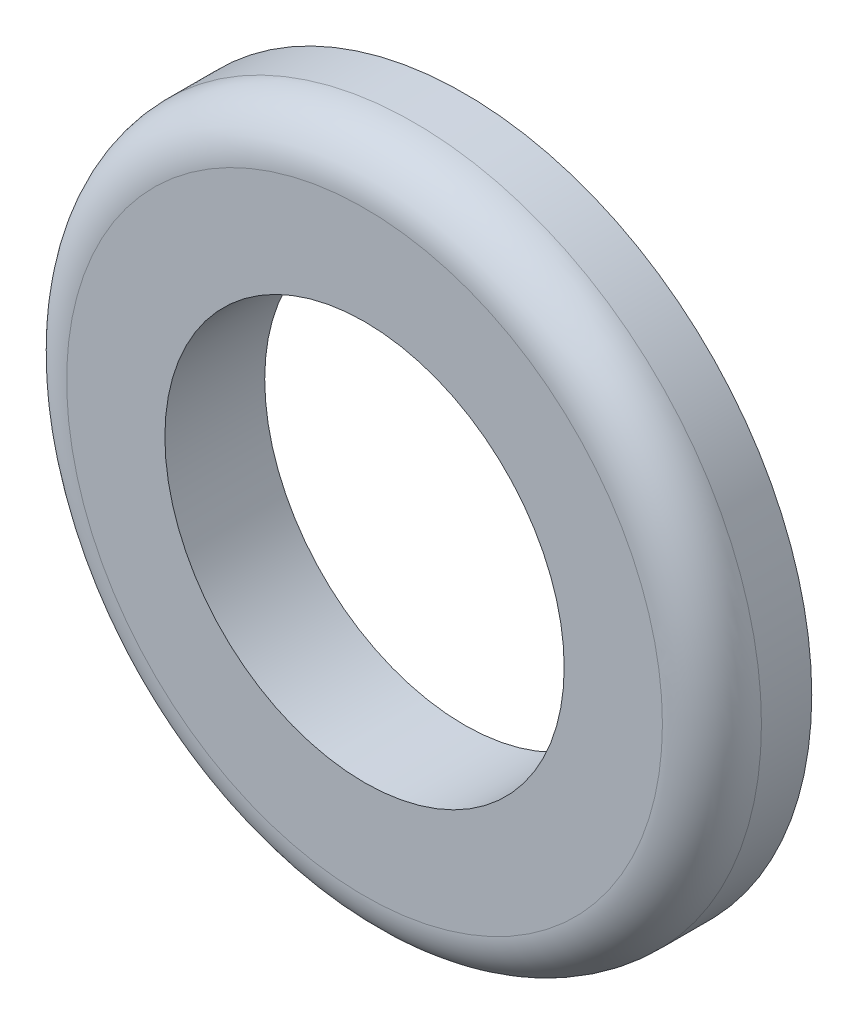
from build123d import *

# Parameters (mm, degrees)
SKETCH1_R           = 5.5245
SKETCH1_R_2         = 3.175
BOSS_EXTRUDE1_DEPTH = 1.5875
FILLET1_R           = 0.7874


with BuildPart() as part:
    # Sketch1 → Boss-Extrude1 (new body)
    with BuildSketch(Plane.XY):
        Circle(SKETCH1_R)
        Circle(SKETCH1_R_2, mode=Mode.SUBTRACT)
    extrude(amount=BOSS_EXTRUDE1_DEPTH)

    # Fillet1
    fillet1_edges = [part.edges().sort_by_distance(p)[0] for p in [
        (-5.5245, 0, 1.5875),
    ]]
    fillet(fillet1_edges, radius=FILLET1_R)


solid = part.part
